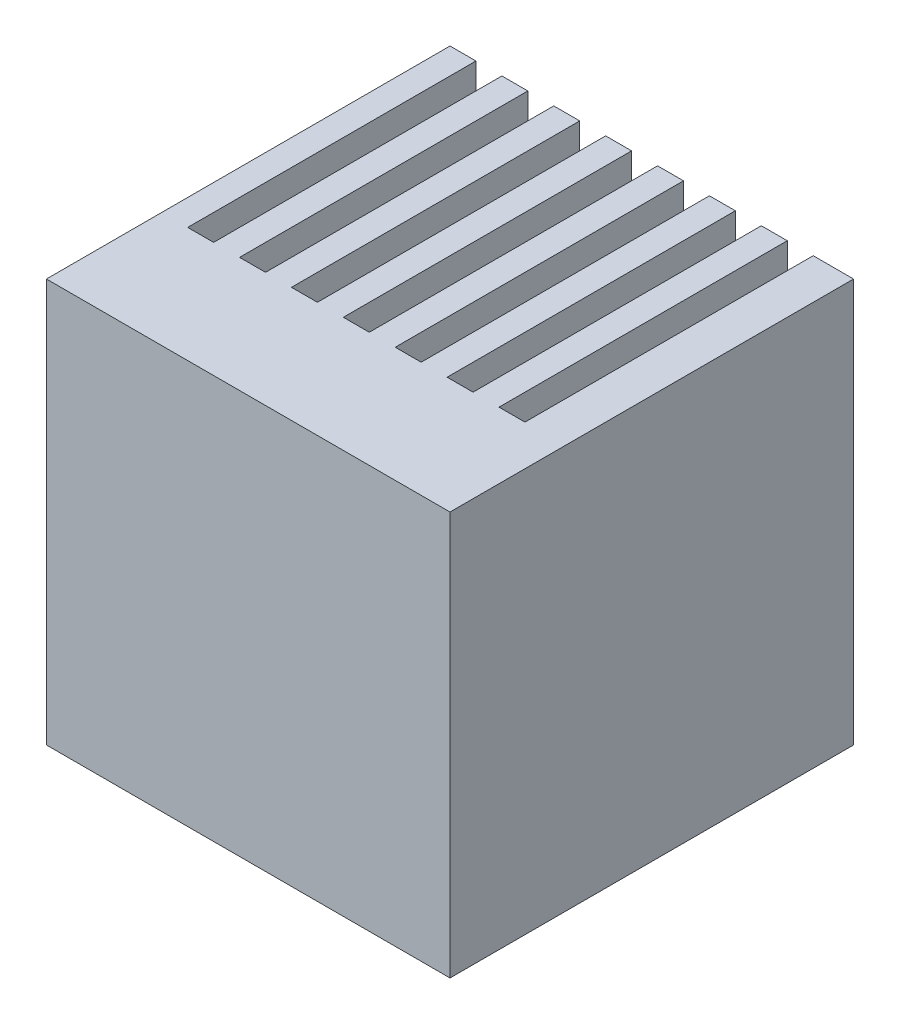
ISO-10303-21;
HEADER;
FILE_DESCRIPTION(('STEP AP214'),'2;1');
FILE_NAME('part.step','',(''),(''),'','','');
FILE_SCHEMA(('AUTOMOTIVE_DESIGN { 1 0 10303 214 1 1 1 1 }'));
ENDSEC;
DATA;
#1=APPLICATION_CONTEXT('core data for automotive mechanical design processes');
#2=APPLICATION_PROTOCOL_DEFINITION('international standard','automotive_design',2000,#1);
#3=PRODUCT_CONTEXT('',#1,'mechanical');
#4=PRODUCT('Part','Part','',(#3));
#5=PRODUCT_RELATED_PRODUCT_CATEGORY('part','',(#4));
#6=PRODUCT_DEFINITION_FORMATION('','',#4);
#7=PRODUCT_DEFINITION_CONTEXT('part definition',#1,'design');
#8=PRODUCT_DEFINITION('design','',#6,#7);
#9=PRODUCT_DEFINITION_SHAPE('','',#8);
#10=(LENGTH_UNIT() NAMED_UNIT(*) SI_UNIT(.MILLI.,.METRE.));
#11=(NAMED_UNIT(*) PLANE_ANGLE_UNIT() SI_UNIT($,.RADIAN.));
#12=(NAMED_UNIT(*) SI_UNIT($,.STERADIAN.) SOLID_ANGLE_UNIT());
#13=UNCERTAINTY_MEASURE_WITH_UNIT(LENGTH_MEASURE(1.E-05),#10,'distance_accuracy_value','');
#14=(GEOMETRIC_REPRESENTATION_CONTEXT(3) GLOBAL_UNCERTAINTY_ASSIGNED_CONTEXT((#13)) GLOBAL_UNIT_ASSIGNED_CONTEXT((#10,
#11,#12)) REPRESENTATION_CONTEXT('',''));
#15=CARTESIAN_POINT('',(0.,0.,0.));
#16=DIRECTION('',(0.,0.,1.));
#17=DIRECTION('',(1.,0.,0.));
#18=AXIS2_PLACEMENT_3D('',#15,#16,#17);
#19=CARTESIAN_POINT('',(0.,28.,0.));
#20=DIRECTION('',(0.,0.,1.));
#21=DIRECTION('',(1.,0.,0.));
#22=AXIS2_PLACEMENT_3D('',#19,#20,#21);
#23=PLANE('',#22);
#24=DIRECTION('',(-1.,0.,0.));
#25=VECTOR('',#24,1.);
#26=CARTESIAN_POINT('',(0.,28.,0.));
#27=LINE('',#26,#25);
#28=CARTESIAN_POINT('',(5.4,28.,0.));
#29=VERTEX_POINT('',#28);
#30=CARTESIAN_POINT('',(3.6,28.,0.));
#31=VERTEX_POINT('',#30);
#32=EDGE_CURVE('E448',#29,#31,#27,.T.);
#33=ORIENTED_EDGE('',*,*,#32,.F.);
#34=DIRECTION('',(0.,1.,0.));
#35=VECTOR('',#34,1.);
#36=CARTESIAN_POINT('',(5.4,0.,0.));
#37=LINE('',#36,#35);
#38=CARTESIAN_POINT('',(5.4,0.,0.));
#39=VERTEX_POINT('',#38);
#40=EDGE_CURVE('E274',#39,#29,#37,.T.);
#41=ORIENTED_EDGE('',*,*,#40,.F.);
#42=DIRECTION('',(-1.,0.,0.));
#43=VECTOR('',#42,1.);
#44=CARTESIAN_POINT('',(0.,0.,0.));
#45=LINE('',#44,#43);
#46=CARTESIAN_POINT('',(3.6,0.,0.));
#47=VERTEX_POINT('',#46);
#48=EDGE_CURVE('E264',#39,#47,#45,.T.);
#49=ORIENTED_EDGE('',*,*,#48,.T.);
#50=DIRECTION('',(0.,1.,0.));
#51=VECTOR('',#50,1.);
#52=CARTESIAN_POINT('',(3.6,0.,0.));
#53=LINE('',#52,#51);
#54=EDGE_CURVE('E428',#47,#31,#53,.T.);
#55=ORIENTED_EDGE('',*,*,#54,.T.);
#56=EDGE_LOOP('',(#33,#41,#49,#55));
#57=FACE_BOUND('',#56,.T.);
#58=ADVANCED_FACE('F35',(#57),#23,.F.);
#59=CARTESIAN_POINT('',(9.,0.,0.));
#60=VERTEX_POINT('',#59);
#61=CARTESIAN_POINT('',(7.2,0.,0.));
#62=VERTEX_POINT('',#61);
#63=EDGE_CURVE('E488',#60,#62,#45,.T.);
#64=ORIENTED_EDGE('',*,*,#63,.T.);
#65=DIRECTION('',(0.,1.,0.));
#66=VECTOR('',#65,1.);
#67=CARTESIAN_POINT('',(7.2,0.,0.));
#68=LINE('',#67,#66);
#69=CARTESIAN_POINT('',(7.2,28.,0.));
#70=VERTEX_POINT('',#69);
#71=EDGE_CURVE('E277',#62,#70,#68,.T.);
#72=ORIENTED_EDGE('',*,*,#71,.T.);
#73=CARTESIAN_POINT('',(9.,28.,0.));
#74=VERTEX_POINT('',#73);
#75=EDGE_CURVE('E531',#74,#70,#27,.T.);
#76=ORIENTED_EDGE('',*,*,#75,.F.);
#77=DIRECTION('',(0.,1.,0.));
#78=VECTOR('',#77,1.);
#79=CARTESIAN_POINT('',(9.,0.,0.));
#80=LINE('',#79,#78);
#81=EDGE_CURVE('E272',#60,#74,#80,.T.);
#82=ORIENTED_EDGE('',*,*,#81,.F.);
#83=EDGE_LOOP('',(#64,#72,#76,#82));
#84=FACE_BOUND('',#83,.T.);
#85=ADVANCED_FACE('F512',(#84),#23,.F.);
#86=CARTESIAN_POINT('',(12.6,0.,0.));
#87=VERTEX_POINT('',#86);
#88=CARTESIAN_POINT('',(10.8,0.,0.));
#89=VERTEX_POINT('',#88);
#90=EDGE_CURVE('E500',#87,#89,#45,.T.);
#91=ORIENTED_EDGE('',*,*,#90,.T.);
#92=DIRECTION('',(0.,1.,0.));
#93=VECTOR('',#92,1.);
#94=CARTESIAN_POINT('',(10.8,0.,0.));
#95=LINE('',#94,#93);
#96=CARTESIAN_POINT('',(10.8,28.,0.));
#97=VERTEX_POINT('',#96);
#98=EDGE_CURVE('E299',#89,#97,#95,.T.);
#99=ORIENTED_EDGE('',*,*,#98,.T.);
#100=CARTESIAN_POINT('',(12.6,28.,0.));
#101=VERTEX_POINT('',#100);
#102=EDGE_CURVE('E527',#101,#97,#27,.T.);
#103=ORIENTED_EDGE('',*,*,#102,.F.);
#104=DIRECTION('',(0.,1.,0.));
#105=VECTOR('',#104,1.);
#106=CARTESIAN_POINT('',(12.6,0.,0.));
#107=LINE('',#106,#105);
#108=EDGE_CURVE('E294',#87,#101,#107,.T.);
#109=ORIENTED_EDGE('',*,*,#108,.F.);
#110=EDGE_LOOP('',(#91,#99,#103,#109));
#111=FACE_BOUND('',#110,.T.);
#112=ADVANCED_FACE('F526',(#111),#23,.F.);
#113=CARTESIAN_POINT('',(16.2,0.,0.));
#114=VERTEX_POINT('',#113);
#115=CARTESIAN_POINT('',(14.4,0.,0.));
#116=VERTEX_POINT('',#115);
#117=EDGE_CURVE('E495',#114,#116,#45,.T.);
#118=ORIENTED_EDGE('',*,*,#117,.T.);
#119=DIRECTION('',(0.,1.,0.));
#120=VECTOR('',#119,1.);
#121=CARTESIAN_POINT('',(14.4,0.,0.));
#122=LINE('',#121,#120);
#123=CARTESIAN_POINT('',(14.4,28.,0.));
#124=VERTEX_POINT('',#123);
#125=EDGE_CURVE('E325',#116,#124,#122,.T.);
#126=ORIENTED_EDGE('',*,*,#125,.T.);
#127=CARTESIAN_POINT('',(16.2,28.,0.));
#128=VERTEX_POINT('',#127);
#129=EDGE_CURVE('E530',#128,#124,#27,.T.);
#130=ORIENTED_EDGE('',*,*,#129,.F.);
#131=DIRECTION('',(0.,1.,0.));
#132=VECTOR('',#131,1.);
#133=CARTESIAN_POINT('',(16.2,0.,0.));
#134=LINE('',#133,#132);
#135=EDGE_CURVE('E320',#114,#128,#134,.T.);
#136=ORIENTED_EDGE('',*,*,#135,.F.);
#137=EDGE_LOOP('',(#118,#126,#130,#136));
#138=FACE_BOUND('',#137,.T.);
#139=ADVANCED_FACE('F560',(#138),#23,.F.);
#140=CARTESIAN_POINT('',(19.8,0.,0.));
#141=VERTEX_POINT('',#140);
#142=CARTESIAN_POINT('',(18.,0.,0.));
#143=VERTEX_POINT('',#142);
#144=EDGE_CURVE('E490',#141,#143,#45,.T.);
#145=ORIENTED_EDGE('',*,*,#144,.T.);
#146=DIRECTION('',(0.,1.,0.));
#147=VECTOR('',#146,1.);
#148=CARTESIAN_POINT('',(18.,0.,0.));
#149=LINE('',#148,#147);
#150=CARTESIAN_POINT('',(18.,28.,0.));
#151=VERTEX_POINT('',#150);
#152=EDGE_CURVE('E351',#143,#151,#149,.T.);
#153=ORIENTED_EDGE('',*,*,#152,.T.);
#154=CARTESIAN_POINT('',(19.8,28.,0.));
#155=VERTEX_POINT('',#154);
#156=EDGE_CURVE('E533',#155,#151,#27,.T.);
#157=ORIENTED_EDGE('',*,*,#156,.F.);
#158=DIRECTION('',(0.,1.,0.));
#159=VECTOR('',#158,1.);
#160=CARTESIAN_POINT('',(19.8,0.,0.));
#161=LINE('',#160,#159);
#162=EDGE_CURVE('E346',#141,#155,#161,.T.);
#163=ORIENTED_EDGE('',*,*,#162,.F.);
#164=EDGE_LOOP('',(#145,#153,#157,#163));
#165=FACE_BOUND('',#164,.T.);
#166=ADVANCED_FACE('F549',(#165),#23,.F.);
#167=CARTESIAN_POINT('',(23.4,0.,0.));
#168=VERTEX_POINT('',#167);
#169=CARTESIAN_POINT('',(21.6,0.,0.));
#170=VERTEX_POINT('',#169);
#171=EDGE_CURVE('E458',#168,#170,#45,.T.);
#172=ORIENTED_EDGE('',*,*,#171,.T.);
#173=DIRECTION('',(0.,1.,0.));
#174=VECTOR('',#173,1.);
#175=CARTESIAN_POINT('',(21.6,0.,0.));
#176=LINE('',#175,#174);
#177=CARTESIAN_POINT('',(21.6,28.,0.));
#178=VERTEX_POINT('',#177);
#179=EDGE_CURVE('E377',#170,#178,#176,.T.);
#180=ORIENTED_EDGE('',*,*,#179,.T.);
#181=CARTESIAN_POINT('',(23.4,28.,0.));
#182=VERTEX_POINT('',#181);
#183=EDGE_CURVE('E447',#182,#178,#27,.T.);
#184=ORIENTED_EDGE('',*,*,#183,.F.);
#185=DIRECTION('',(0.,1.,0.));
#186=VECTOR('',#185,1.);
#187=CARTESIAN_POINT('',(23.4,0.,0.));
#188=LINE('',#187,#186);
#189=EDGE_CURVE('E372',#168,#182,#188,.T.);
#190=ORIENTED_EDGE('',*,*,#189,.F.);
#191=EDGE_LOOP('',(#172,#180,#184,#190));
#192=FACE_BOUND('',#191,.T.);
#193=ADVANCED_FACE('F595',(#192),#23,.F.);
#194=CARTESIAN_POINT('',(1.8,28.,0.));
#195=VERTEX_POINT('',#194);
#196=CARTESIAN_POINT('',(0.,28.,0.));
#197=VERTEX_POINT('',#196);
#198=EDGE_CURVE('E442',#195,#197,#27,.T.);
#199=ORIENTED_EDGE('',*,*,#198,.F.);
#200=DIRECTION('',(0.,1.,0.));
#201=VECTOR('',#200,1.);
#202=CARTESIAN_POINT('',(1.8,0.,0.));
#203=LINE('',#202,#201);
#204=CARTESIAN_POINT('',(1.8,0.,0.));
#205=VERTEX_POINT('',#204);
#206=EDGE_CURVE('E425',#205,#195,#203,.T.);
#207=ORIENTED_EDGE('',*,*,#206,.F.);
#208=CARTESIAN_POINT('',(0.,0.,0.));
#209=VERTEX_POINT('',#208);
#210=EDGE_CURVE('E455',#205,#209,#45,.T.);
#211=ORIENTED_EDGE('',*,*,#210,.T.);
#212=DIRECTION('',(0.,-1.,0.));
#213=VECTOR('',#212,1.);
#214=CARTESIAN_POINT('',(0.,28.,0.));
#215=LINE('',#214,#213);
#216=EDGE_CURVE('E446',#197,#209,#215,.T.);
#217=ORIENTED_EDGE('',*,*,#216,.F.);
#218=EDGE_LOOP('',(#199,#207,#211,#217));
#219=FACE_BOUND('',#218,.T.);
#220=ADVANCED_FACE('F588',(#219),#23,.F.);
#221=CARTESIAN_POINT('',(0.,28.,0.));
#222=DIRECTION('',(1.,0.,0.));
#223=DIRECTION('',(0.,0.,-1.));
#224=AXIS2_PLACEMENT_3D('',#221,#222,#223);
#225=PLANE('',#224);
#226=DIRECTION('',(0.,0.,1.));
#227=VECTOR('',#226,1.);
#228=CARTESIAN_POINT('',(0.,0.,0.));
#229=LINE('',#228,#227);
#230=CARTESIAN_POINT('',(0.,0.,28.));
#231=VERTEX_POINT('',#230);
#232=EDGE_CURVE('E427',#209,#231,#229,.T.);
#233=ORIENTED_EDGE('',*,*,#232,.T.);
#234=DIRECTION('',(0.,-1.,0.));
#235=VECTOR('',#234,1.);
#236=CARTESIAN_POINT('',(0.,28.,28.));
#237=LINE('',#236,#235);
#238=CARTESIAN_POINT('',(0.,28.,28.));
#239=VERTEX_POINT('',#238);
#240=EDGE_CURVE('E11',#239,#231,#237,.T.);
#241=ORIENTED_EDGE('',*,*,#240,.F.);
#242=DIRECTION('',(0.,0.,1.));
#243=VECTOR('',#242,1.);
#244=CARTESIAN_POINT('',(0.,28.,0.));
#245=LINE('',#244,#243);
#246=EDGE_CURVE('E434',#197,#239,#245,.T.);
#247=ORIENTED_EDGE('',*,*,#246,.F.);
#248=ORIENTED_EDGE('',*,*,#216,.T.);
#249=EDGE_LOOP('',(#233,#241,#247,#248));
#250=FACE_BOUND('',#249,.T.);
#251=ADVANCED_FACE('F37',(#250),#225,.F.);
#252=CARTESIAN_POINT('',(0.,28.,28.));
#253=DIRECTION('',(0.,0.,-1.));
#254=DIRECTION('',(-1.,0.,0.));
#255=AXIS2_PLACEMENT_3D('',#252,#253,#254);
#256=PLANE('',#255);
#257=DIRECTION('',(1.,0.,0.));
#258=VECTOR('',#257,1.);
#259=CARTESIAN_POINT('',(0.,0.,28.));
#260=LINE('',#259,#258);
#261=CARTESIAN_POINT('',(28.,0.,28.));
#262=VERTEX_POINT('',#261);
#263=EDGE_CURVE('E451',#231,#262,#260,.T.);
#264=ORIENTED_EDGE('',*,*,#263,.T.);
#265=DIRECTION('',(0.,-1.,0.));
#266=VECTOR('',#265,1.);
#267=CARTESIAN_POINT('',(28.,28.,28.));
#268=LINE('',#267,#266);
#269=CARTESIAN_POINT('',(28.,28.,28.));
#270=VERTEX_POINT('',#269);
#271=EDGE_CURVE('E43',#270,#262,#268,.T.);
#272=ORIENTED_EDGE('',*,*,#271,.F.);
#273=DIRECTION('',(1.,0.,0.));
#274=VECTOR('',#273,1.);
#275=CARTESIAN_POINT('',(0.,28.,28.));
#276=LINE('',#275,#274);
#277=EDGE_CURVE('E437',#239,#270,#276,.T.);
#278=ORIENTED_EDGE('',*,*,#277,.F.);
#279=ORIENTED_EDGE('',*,*,#240,.T.);
#280=EDGE_LOOP('',(#264,#272,#278,#279));
#281=FACE_BOUND('',#280,.T.);
#282=ADVANCED_FACE('F482',(#281),#256,.F.);
#283=CARTESIAN_POINT('',(28.,28.,0.));
#284=DIRECTION('',(-1.,0.,0.));
#285=DIRECTION('',(0.,0.,1.));
#286=AXIS2_PLACEMENT_3D('',#283,#284,#285);
#287=PLANE('',#286);
#288=DIRECTION('',(0.,0.,-1.));
#289=VECTOR('',#288,1.);
#290=CARTESIAN_POINT('',(28.,0.,0.));
#291=LINE('',#290,#289);
#292=CARTESIAN_POINT('',(28.,0.,0.));
#293=VERTEX_POINT('',#292);
#294=EDGE_CURVE('E453',#262,#293,#291,.T.);
#295=ORIENTED_EDGE('',*,*,#294,.T.);
#296=DIRECTION('',(0.,-1.,0.));
#297=VECTOR('',#296,1.);
#298=CARTESIAN_POINT('',(28.,28.,0.));
#299=LINE('',#298,#297);
#300=CARTESIAN_POINT('',(28.,28.,0.));
#301=VERTEX_POINT('',#300);
#302=EDGE_CURVE('E461',#301,#293,#299,.T.);
#303=ORIENTED_EDGE('',*,*,#302,.F.);
#304=DIRECTION('',(0.,0.,-1.));
#305=VECTOR('',#304,1.);
#306=CARTESIAN_POINT('',(28.,28.,0.));
#307=LINE('',#306,#305);
#308=EDGE_CURVE('E440',#270,#301,#307,.T.);
#309=ORIENTED_EDGE('',*,*,#308,.F.);
#310=ORIENTED_EDGE('',*,*,#271,.T.);
#311=EDGE_LOOP('',(#295,#303,#309,#310));
#312=FACE_BOUND('',#311,.T.);
#313=ADVANCED_FACE('F468',(#312),#287,.F.);
#314=CARTESIAN_POINT('',(25.2,0.,0.));
#315=VERTEX_POINT('',#314);
#316=EDGE_CURVE('E438',#293,#315,#45,.T.);
#317=ORIENTED_EDGE('',*,*,#316,.T.);
#318=DIRECTION('',(0.,1.,0.));
#319=VECTOR('',#318,1.);
#320=CARTESIAN_POINT('',(25.2,0.,0.));
#321=LINE('',#320,#319);
#322=CARTESIAN_POINT('',(25.2,28.,0.));
#323=VERTEX_POINT('',#322);
#324=EDGE_CURVE('E402',#315,#323,#321,.T.);
#325=ORIENTED_EDGE('',*,*,#324,.T.);
#326=EDGE_CURVE('E443',#301,#323,#27,.T.);
#327=ORIENTED_EDGE('',*,*,#326,.F.);
#328=ORIENTED_EDGE('',*,*,#302,.T.);
#329=EDGE_LOOP('',(#317,#325,#327,#328));
#330=FACE_BOUND('',#329,.T.);
#331=ADVANCED_FACE('F474',(#330),#23,.F.);
#332=CARTESIAN_POINT('',(0.,28.,0.));
#333=DIRECTION('',(0.,1.,0.));
#334=DIRECTION('',(0.,0.,1.));
#335=AXIS2_PLACEMENT_3D('',#332,#333,#334);
#336=PLANE('',#335);
#337=DIRECTION('',(0.,0.,1.));
#338=VECTOR('',#337,1.);
#339=CARTESIAN_POINT('',(5.4,28.,0.));
#340=LINE('',#339,#338);
#341=CARTESIAN_POINT('',(5.4,28.,20.));
#342=VERTEX_POINT('',#341);
#343=EDGE_CURVE('E250',#29,#342,#340,.T.);
#344=ORIENTED_EDGE('',*,*,#343,.F.);
#345=ORIENTED_EDGE('',*,*,#32,.T.);
#346=DIRECTION('',(0.,0.,-1.));
#347=VECTOR('',#346,1.);
#348=CARTESIAN_POINT('',(3.6,28.,0.));
#349=LINE('',#348,#347);
#350=CARTESIAN_POINT('',(3.6,28.,20.));
#351=VERTEX_POINT('',#350);
#352=EDGE_CURVE('E412',#351,#31,#349,.T.);
#353=ORIENTED_EDGE('',*,*,#352,.F.);
#354=DIRECTION('',(1.,0.,0.));
#355=VECTOR('',#354,1.);
#356=CARTESIAN_POINT('',(1.8,28.,20.));
#357=LINE('',#356,#355);
#358=CARTESIAN_POINT('',(1.8,28.,20.));
#359=VERTEX_POINT('',#358);
#360=EDGE_CURVE('E420',#359,#351,#357,.T.);
#361=ORIENTED_EDGE('',*,*,#360,.F.);
#362=DIRECTION('',(0.,0.,1.));
#363=VECTOR('',#362,1.);
#364=CARTESIAN_POINT('',(1.8,28.,0.));
#365=LINE('',#364,#363);
#366=EDGE_CURVE('E276',#195,#359,#365,.T.);
#367=ORIENTED_EDGE('',*,*,#366,.F.);
#368=ORIENTED_EDGE('',*,*,#198,.T.);
#369=ORIENTED_EDGE('',*,*,#246,.T.);
#370=ORIENTED_EDGE('',*,*,#277,.T.);
#371=ORIENTED_EDGE('',*,*,#308,.T.);
#372=ORIENTED_EDGE('',*,*,#326,.T.);
#373=DIRECTION('',(0.,0.,-1.));
#374=VECTOR('',#373,1.);
#375=CARTESIAN_POINT('',(25.2,28.,0.));
#376=LINE('',#375,#374);
#377=CARTESIAN_POINT('',(25.2,28.,20.));
#378=VERTEX_POINT('',#377);
#379=EDGE_CURVE('E387',#378,#323,#376,.T.);
#380=ORIENTED_EDGE('',*,*,#379,.F.);
#381=DIRECTION('',(1.,0.,0.));
#382=VECTOR('',#381,1.);
#383=CARTESIAN_POINT('',(23.4,28.,20.));
#384=LINE('',#383,#382);
#385=CARTESIAN_POINT('',(23.4,28.,20.));
#386=VERTEX_POINT('',#385);
#387=EDGE_CURVE('E397',#386,#378,#384,.T.);
#388=ORIENTED_EDGE('',*,*,#387,.F.);
#389=DIRECTION('',(0.,0.,1.));
#390=VECTOR('',#389,1.);
#391=CARTESIAN_POINT('',(23.4,28.,0.));
#392=LINE('',#391,#390);
#393=EDGE_CURVE('E394',#182,#386,#392,.T.);
#394=ORIENTED_EDGE('',*,*,#393,.F.);
#395=ORIENTED_EDGE('',*,*,#183,.T.);
#396=DIRECTION('',(0.,0.,-1.));
#397=VECTOR('',#396,1.);
#398=CARTESIAN_POINT('',(21.6,28.,0.));
#399=LINE('',#398,#397);
#400=CARTESIAN_POINT('',(21.6,28.,20.));
#401=VERTEX_POINT('',#400);
#402=EDGE_CURVE('E361',#401,#178,#399,.T.);
#403=ORIENTED_EDGE('',*,*,#402,.F.);
#404=DIRECTION('',(1.,0.,0.));
#405=VECTOR('',#404,1.);
#406=CARTESIAN_POINT('',(19.8,28.,20.));
#407=LINE('',#406,#405);
#408=CARTESIAN_POINT('',(19.8,28.,20.));
#409=VERTEX_POINT('',#408);
#410=EDGE_CURVE('E371',#409,#401,#407,.T.);
#411=ORIENTED_EDGE('',*,*,#410,.F.);
#412=DIRECTION('',(0.,0.,1.));
#413=VECTOR('',#412,1.);
#414=CARTESIAN_POINT('',(19.8,28.,0.));
#415=LINE('',#414,#413);
#416=EDGE_CURVE('E368',#155,#409,#415,.T.);
#417=ORIENTED_EDGE('',*,*,#416,.F.);
#418=ORIENTED_EDGE('',*,*,#156,.T.);
#419=DIRECTION('',(0.,0.,-1.));
#420=VECTOR('',#419,1.);
#421=CARTESIAN_POINT('',(18.,28.,0.));
#422=LINE('',#421,#420);
#423=CARTESIAN_POINT('',(18.,28.,20.));
#424=VERTEX_POINT('',#423);
#425=EDGE_CURVE('E335',#424,#151,#422,.T.);
#426=ORIENTED_EDGE('',*,*,#425,.F.);
#427=DIRECTION('',(1.,0.,0.));
#428=VECTOR('',#427,1.);
#429=CARTESIAN_POINT('',(16.2,28.,20.));
#430=LINE('',#429,#428);
#431=CARTESIAN_POINT('',(16.2,28.,20.));
#432=VERTEX_POINT('',#431);
#433=EDGE_CURVE('E345',#432,#424,#430,.T.);
#434=ORIENTED_EDGE('',*,*,#433,.F.);
#435=DIRECTION('',(0.,0.,1.));
#436=VECTOR('',#435,1.);
#437=CARTESIAN_POINT('',(16.2,28.,0.));
#438=LINE('',#437,#436);
#439=EDGE_CURVE('E342',#128,#432,#438,.T.);
#440=ORIENTED_EDGE('',*,*,#439,.F.);
#441=ORIENTED_EDGE('',*,*,#129,.T.);
#442=DIRECTION('',(0.,0.,-1.));
#443=VECTOR('',#442,1.);
#444=CARTESIAN_POINT('',(14.4,28.,0.));
#445=LINE('',#444,#443);
#446=CARTESIAN_POINT('',(14.4,28.,20.));
#447=VERTEX_POINT('',#446);
#448=EDGE_CURVE('E309',#447,#124,#445,.T.);
#449=ORIENTED_EDGE('',*,*,#448,.F.);
#450=DIRECTION('',(1.,0.,0.));
#451=VECTOR('',#450,1.);
#452=CARTESIAN_POINT('',(12.6,28.,20.));
#453=LINE('',#452,#451);
#454=CARTESIAN_POINT('',(12.6,28.,20.));
#455=VERTEX_POINT('',#454);
#456=EDGE_CURVE('E319',#455,#447,#453,.T.);
#457=ORIENTED_EDGE('',*,*,#456,.F.);
#458=DIRECTION('',(0.,0.,1.));
#459=VECTOR('',#458,1.);
#460=CARTESIAN_POINT('',(12.6,28.,0.));
#461=LINE('',#460,#459);
#462=EDGE_CURVE('E316',#101,#455,#461,.T.);
#463=ORIENTED_EDGE('',*,*,#462,.F.);
#464=ORIENTED_EDGE('',*,*,#102,.T.);
#465=DIRECTION('',(0.,0.,-1.));
#466=VECTOR('',#465,1.);
#467=CARTESIAN_POINT('',(10.8,28.,0.));
#468=LINE('',#467,#466);
#469=CARTESIAN_POINT('',(10.8,28.,20.));
#470=VERTEX_POINT('',#469);
#471=EDGE_CURVE('E285',#470,#97,#468,.T.);
#472=ORIENTED_EDGE('',*,*,#471,.F.);
#473=DIRECTION('',(1.,0.,0.));
#474=VECTOR('',#473,1.);
#475=CARTESIAN_POINT('',(9.,28.,20.));
#476=LINE('',#475,#474);
#477=CARTESIAN_POINT('',(9.,28.,20.));
#478=VERTEX_POINT('',#477);
#479=EDGE_CURVE('E293',#478,#470,#476,.T.);
#480=ORIENTED_EDGE('',*,*,#479,.F.);
#481=DIRECTION('',(0.,0.,1.));
#482=VECTOR('',#481,1.);
#483=CARTESIAN_POINT('',(9.,28.,0.));
#484=LINE('',#483,#482);
#485=EDGE_CURVE('E290',#74,#478,#484,.T.);
#486=ORIENTED_EDGE('',*,*,#485,.F.);
#487=ORIENTED_EDGE('',*,*,#75,.T.);
#488=DIRECTION('',(0.,0.,-1.));
#489=VECTOR('',#488,1.);
#490=CARTESIAN_POINT('',(7.2,28.,0.));
#491=LINE('',#490,#489);
#492=CARTESIAN_POINT('',(7.2,28.,20.));
#493=VERTEX_POINT('',#492);
#494=EDGE_CURVE('E265',#493,#70,#491,.T.);
#495=ORIENTED_EDGE('',*,*,#494,.F.);
#496=DIRECTION('',(1.,0.,0.));
#497=VECTOR('',#496,1.);
#498=CARTESIAN_POINT('',(5.4,28.,20.));
#499=LINE('',#498,#497);
#500=EDGE_CURVE('E267',#342,#493,#499,.T.);
#501=ORIENTED_EDGE('',*,*,#500,.F.);
#502=EDGE_LOOP('',(#344,#345,#353,#361,#367,#368,#369,#370,#371,#372,#380,#388,#394,#395,#403,
#411,#417,#418,#426,#434,#440,#441,#449,#457,#463,#464,#472,#480,#486,#487,#495,#501));
#503=FACE_BOUND('',#502,.T.);
#504=ADVANCED_FACE('F478',(#503),#336,.T.);
#505=CARTESIAN_POINT('',(0.,0.,0.));
#506=DIRECTION('',(0.,1.,0.));
#507=DIRECTION('',(0.,0.,1.));
#508=AXIS2_PLACEMENT_3D('',#505,#506,#507);
#509=PLANE('',#508);
#510=ORIENTED_EDGE('',*,*,#48,.F.);
#511=DIRECTION('',(0.,0.,1.));
#512=VECTOR('',#511,1.);
#513=CARTESIAN_POINT('',(5.4,0.,0.));
#514=LINE('',#513,#512);
#515=CARTESIAN_POINT('',(5.4,0.,20.));
#516=VERTEX_POINT('',#515);
#517=EDGE_CURVE('E247',#39,#516,#514,.T.);
#518=ORIENTED_EDGE('',*,*,#517,.T.);
#519=DIRECTION('',(1.,0.,0.));
#520=VECTOR('',#519,1.);
#521=CARTESIAN_POINT('',(5.4,0.,20.));
#522=LINE('',#521,#520);
#523=CARTESIAN_POINT('',(7.2,0.,20.));
#524=VERTEX_POINT('',#523);
#525=EDGE_CURVE('E257',#516,#524,#522,.T.);
#526=ORIENTED_EDGE('',*,*,#525,.T.);
#527=DIRECTION('',(0.,0.,-1.));
#528=VECTOR('',#527,1.);
#529=CARTESIAN_POINT('',(7.2,0.,0.));
#530=LINE('',#529,#528);
#531=EDGE_CURVE('E50',#524,#62,#530,.T.);
#532=ORIENTED_EDGE('',*,*,#531,.T.);
#533=ORIENTED_EDGE('',*,*,#63,.F.);
#534=DIRECTION('',(0.,0.,1.));
#535=VECTOR('',#534,1.);
#536=CARTESIAN_POINT('',(9.,0.,0.));
#537=LINE('',#536,#535);
#538=CARTESIAN_POINT('',(9.,0.,20.));
#539=VERTEX_POINT('',#538);
#540=EDGE_CURVE('E281',#60,#539,#537,.T.);
#541=ORIENTED_EDGE('',*,*,#540,.T.);
#542=DIRECTION('',(1.,0.,0.));
#543=VECTOR('',#542,1.);
#544=CARTESIAN_POINT('',(9.,0.,20.));
#545=LINE('',#544,#543);
#546=CARTESIAN_POINT('',(10.8,0.,20.));
#547=VERTEX_POINT('',#546);
#548=EDGE_CURVE('E284',#539,#547,#545,.T.);
#549=ORIENTED_EDGE('',*,*,#548,.T.);
#550=DIRECTION('',(0.,0.,-1.));
#551=VECTOR('',#550,1.);
#552=CARTESIAN_POINT('',(10.8,0.,0.));
#553=LINE('',#552,#551);
#554=EDGE_CURVE('E58',#547,#89,#553,.T.);
#555=ORIENTED_EDGE('',*,*,#554,.T.);
#556=ORIENTED_EDGE('',*,*,#90,.F.);
#557=DIRECTION('',(0.,0.,1.));
#558=VECTOR('',#557,1.);
#559=CARTESIAN_POINT('',(12.6,0.,0.));
#560=LINE('',#559,#558);
#561=CARTESIAN_POINT('',(12.6,0.,20.));
#562=VERTEX_POINT('',#561);
#563=EDGE_CURVE('E305',#87,#562,#560,.T.);
#564=ORIENTED_EDGE('',*,*,#563,.T.);
#565=DIRECTION('',(1.,0.,0.));
#566=VECTOR('',#565,1.);
#567=CARTESIAN_POINT('',(12.6,0.,20.));
#568=LINE('',#567,#566);
#569=CARTESIAN_POINT('',(14.4,0.,20.));
#570=VERTEX_POINT('',#569);
#571=EDGE_CURVE('E308',#562,#570,#568,.T.);
#572=ORIENTED_EDGE('',*,*,#571,.T.);
#573=DIRECTION('',(0.,0.,-1.));
#574=VECTOR('',#573,1.);
#575=CARTESIAN_POINT('',(14.4,0.,0.));
#576=LINE('',#575,#574);
#577=EDGE_CURVE('E312',#570,#116,#576,.T.);
#578=ORIENTED_EDGE('',*,*,#577,.T.);
#579=ORIENTED_EDGE('',*,*,#117,.F.);
#580=DIRECTION('',(0.,0.,1.));
#581=VECTOR('',#580,1.);
#582=CARTESIAN_POINT('',(16.2,0.,0.));
#583=LINE('',#582,#581);
#584=CARTESIAN_POINT('',(16.2,0.,20.));
#585=VERTEX_POINT('',#584);
#586=EDGE_CURVE('E331',#114,#585,#583,.T.);
#587=ORIENTED_EDGE('',*,*,#586,.T.);
#588=DIRECTION('',(1.,0.,0.));
#589=VECTOR('',#588,1.);
#590=CARTESIAN_POINT('',(16.2,0.,20.));
#591=LINE('',#590,#589);
#592=CARTESIAN_POINT('',(18.,0.,20.));
#593=VERTEX_POINT('',#592);
#594=EDGE_CURVE('E334',#585,#593,#591,.T.);
#595=ORIENTED_EDGE('',*,*,#594,.T.);
#596=DIRECTION('',(0.,0.,-1.));
#597=VECTOR('',#596,1.);
#598=CARTESIAN_POINT('',(18.,0.,0.));
#599=LINE('',#598,#597);
#600=EDGE_CURVE('E338',#593,#143,#599,.T.);
#601=ORIENTED_EDGE('',*,*,#600,.T.);
#602=ORIENTED_EDGE('',*,*,#144,.F.);
#603=DIRECTION('',(0.,0.,1.));
#604=VECTOR('',#603,1.);
#605=CARTESIAN_POINT('',(19.8,0.,0.));
#606=LINE('',#605,#604);
#607=CARTESIAN_POINT('',(19.8,0.,20.));
#608=VERTEX_POINT('',#607);
#609=EDGE_CURVE('E357',#141,#608,#606,.T.);
#610=ORIENTED_EDGE('',*,*,#609,.T.);
#611=DIRECTION('',(1.,0.,0.));
#612=VECTOR('',#611,1.);
#613=CARTESIAN_POINT('',(19.8,0.,20.));
#614=LINE('',#613,#612);
#615=CARTESIAN_POINT('',(21.6,0.,20.));
#616=VERTEX_POINT('',#615);
#617=EDGE_CURVE('E360',#608,#616,#614,.T.);
#618=ORIENTED_EDGE('',*,*,#617,.T.);
#619=DIRECTION('',(0.,0.,-1.));
#620=VECTOR('',#619,1.);
#621=CARTESIAN_POINT('',(21.6,0.,0.));
#622=LINE('',#621,#620);
#623=EDGE_CURVE('E364',#616,#170,#622,.T.);
#624=ORIENTED_EDGE('',*,*,#623,.T.);
#625=ORIENTED_EDGE('',*,*,#171,.F.);
#626=DIRECTION('',(0.,0.,1.));
#627=VECTOR('',#626,1.);
#628=CARTESIAN_POINT('',(23.4,0.,0.));
#629=LINE('',#628,#627);
#630=CARTESIAN_POINT('',(23.4,0.,20.));
#631=VERTEX_POINT('',#630);
#632=EDGE_CURVE('E383',#168,#631,#629,.T.);
#633=ORIENTED_EDGE('',*,*,#632,.T.);
#634=DIRECTION('',(1.,0.,0.));
#635=VECTOR('',#634,1.);
#636=CARTESIAN_POINT('',(23.4,0.,20.));
#637=LINE('',#636,#635);
#638=CARTESIAN_POINT('',(25.2,0.,20.));
#639=VERTEX_POINT('',#638);
#640=EDGE_CURVE('E386',#631,#639,#637,.T.);
#641=ORIENTED_EDGE('',*,*,#640,.T.);
#642=DIRECTION('',(0.,0.,-1.));
#643=VECTOR('',#642,1.);
#644=CARTESIAN_POINT('',(25.2,0.,0.));
#645=LINE('',#644,#643);
#646=EDGE_CURVE('E390',#639,#315,#645,.T.);
#647=ORIENTED_EDGE('',*,*,#646,.T.);
#648=ORIENTED_EDGE('',*,*,#316,.F.);
#649=ORIENTED_EDGE('',*,*,#294,.F.);
#650=ORIENTED_EDGE('',*,*,#263,.F.);
#651=ORIENTED_EDGE('',*,*,#232,.F.);
#652=ORIENTED_EDGE('',*,*,#210,.F.);
#653=DIRECTION('',(0.,0.,1.));
#654=VECTOR('',#653,1.);
#655=CARTESIAN_POINT('',(1.8,0.,0.));
#656=LINE('',#655,#654);
#657=CARTESIAN_POINT('',(1.8,0.,20.));
#658=VERTEX_POINT('',#657);
#659=EDGE_CURVE('E408',#205,#658,#656,.T.);
#660=ORIENTED_EDGE('',*,*,#659,.T.);
#661=DIRECTION('',(1.,0.,0.));
#662=VECTOR('',#661,1.);
#663=CARTESIAN_POINT('',(1.8,0.,20.));
#664=LINE('',#663,#662);
#665=CARTESIAN_POINT('',(3.6,0.,20.));
#666=VERTEX_POINT('',#665);
#667=EDGE_CURVE('E411',#658,#666,#664,.T.);
#668=ORIENTED_EDGE('',*,*,#667,.T.);
#669=DIRECTION('',(0.,0.,-1.));
#670=VECTOR('',#669,1.);
#671=CARTESIAN_POINT('',(3.6,0.,0.));
#672=LINE('',#671,#670);
#673=EDGE_CURVE('E415',#666,#47,#672,.T.);
#674=ORIENTED_EDGE('',*,*,#673,.T.);
#675=EDGE_LOOP('',(#510,#518,#526,#532,#533,#541,#549,#555,#556,#564,#572,#578,#579,#587,#595,
#601,#602,#610,#618,#624,#625,#633,#641,#647,#648,#649,#650,#651,#652,#660,#668,#674));
#676=FACE_BOUND('',#675,.T.);
#677=ADVANCED_FACE('F262',(#676),#509,.F.);
#678=CARTESIAN_POINT('',(1.8,0.,0.));
#679=DIRECTION('',(-1.,0.,0.));
#680=DIRECTION('',(0.,0.,1.));
#681=AXIS2_PLACEMENT_3D('',#678,#679,#680);
#682=PLANE('',#681);
#683=ORIENTED_EDGE('',*,*,#366,.T.);
#684=DIRECTION('',(0.,1.,0.));
#685=VECTOR('',#684,1.);
#686=CARTESIAN_POINT('',(1.8,0.,20.));
#687=LINE('',#686,#685);
#688=EDGE_CURVE('E417',#658,#359,#687,.T.);
#689=ORIENTED_EDGE('',*,*,#688,.F.);
#690=ORIENTED_EDGE('',*,*,#659,.F.);
#691=ORIENTED_EDGE('',*,*,#206,.T.);
#692=EDGE_LOOP('',(#683,#689,#690,#691));
#693=FACE_BOUND('',#692,.T.);
#694=ADVANCED_FACE('F601',(#693),#682,.F.);
#695=CARTESIAN_POINT('',(3.6,0.,0.));
#696=DIRECTION('',(1.,0.,0.));
#697=DIRECTION('',(0.,0.,-1.));
#698=AXIS2_PLACEMENT_3D('',#695,#696,#697);
#699=PLANE('',#698);
#700=ORIENTED_EDGE('',*,*,#352,.T.);
#701=ORIENTED_EDGE('',*,*,#54,.F.);
#702=ORIENTED_EDGE('',*,*,#673,.F.);
#703=DIRECTION('',(0.,1.,0.));
#704=VECTOR('',#703,1.);
#705=CARTESIAN_POINT('',(3.6,0.,20.));
#706=LINE('',#705,#704);
#707=EDGE_CURVE('E431',#666,#351,#706,.T.);
#708=ORIENTED_EDGE('',*,*,#707,.T.);
#709=EDGE_LOOP('',(#700,#701,#702,#708));
#710=FACE_BOUND('',#709,.T.);
#711=ADVANCED_FACE('F609',(#710),#699,.F.);
#712=CARTESIAN_POINT('',(1.8,0.,20.));
#713=DIRECTION('',(0.,0.,1.));
#714=DIRECTION('',(1.,0.,0.));
#715=AXIS2_PLACEMENT_3D('',#712,#713,#714);
#716=PLANE('',#715);
#717=ORIENTED_EDGE('',*,*,#360,.T.);
#718=ORIENTED_EDGE('',*,*,#707,.F.);
#719=ORIENTED_EDGE('',*,*,#667,.F.);
#720=ORIENTED_EDGE('',*,*,#688,.T.);
#721=EDGE_LOOP('',(#717,#718,#719,#720));
#722=FACE_BOUND('',#721,.T.);
#723=ADVANCED_FACE('F605',(#722),#716,.F.);
#724=CARTESIAN_POINT('',(23.4,0.,0.));
#725=DIRECTION('',(-1.,0.,0.));
#726=DIRECTION('',(0.,0.,1.));
#727=AXIS2_PLACEMENT_3D('',#724,#725,#726);
#728=PLANE('',#727);
#729=ORIENTED_EDGE('',*,*,#393,.T.);
#730=DIRECTION('',(0.,1.,0.));
#731=VECTOR('',#730,1.);
#732=CARTESIAN_POINT('',(23.4,0.,20.));
#733=LINE('',#732,#731);
#734=EDGE_CURVE('E393',#631,#386,#733,.T.);
#735=ORIENTED_EDGE('',*,*,#734,.F.);
#736=ORIENTED_EDGE('',*,*,#632,.F.);
#737=ORIENTED_EDGE('',*,*,#189,.T.);
#738=EDGE_LOOP('',(#729,#735,#736,#737));
#739=FACE_BOUND('',#738,.T.);
#740=ADVANCED_FACE('F738',(#739),#728,.F.);
#741=CARTESIAN_POINT('',(25.2,0.,0.));
#742=DIRECTION('',(1.,0.,0.));
#743=DIRECTION('',(0.,0.,-1.));
#744=AXIS2_PLACEMENT_3D('',#741,#742,#743);
#745=PLANE('',#744);
#746=ORIENTED_EDGE('',*,*,#379,.T.);
#747=ORIENTED_EDGE('',*,*,#324,.F.);
#748=ORIENTED_EDGE('',*,*,#646,.F.);
#749=DIRECTION('',(0.,1.,0.));
#750=VECTOR('',#749,1.);
#751=CARTESIAN_POINT('',(25.2,0.,20.));
#752=LINE('',#751,#750);
#753=EDGE_CURVE('E405',#639,#378,#752,.T.);
#754=ORIENTED_EDGE('',*,*,#753,.T.);
#755=EDGE_LOOP('',(#746,#747,#748,#754));
#756=FACE_BOUND('',#755,.T.);
#757=ADVANCED_FACE('F729',(#756),#745,.F.);
#758=CARTESIAN_POINT('',(23.4,0.,20.));
#759=DIRECTION('',(0.,0.,1.));
#760=DIRECTION('',(1.,0.,0.));
#761=AXIS2_PLACEMENT_3D('',#758,#759,#760);
#762=PLANE('',#761);
#763=ORIENTED_EDGE('',*,*,#387,.T.);
#764=ORIENTED_EDGE('',*,*,#753,.F.);
#765=ORIENTED_EDGE('',*,*,#640,.F.);
#766=ORIENTED_EDGE('',*,*,#734,.T.);
#767=EDGE_LOOP('',(#763,#764,#765,#766));
#768=FACE_BOUND('',#767,.T.);
#769=ADVANCED_FACE('F720',(#768),#762,.F.);
#770=CARTESIAN_POINT('',(19.8,0.,0.));
#771=DIRECTION('',(-1.,0.,0.));
#772=DIRECTION('',(0.,0.,1.));
#773=AXIS2_PLACEMENT_3D('',#770,#771,#772);
#774=PLANE('',#773);
#775=ORIENTED_EDGE('',*,*,#416,.T.);
#776=DIRECTION('',(0.,1.,0.));
#777=VECTOR('',#776,1.);
#778=CARTESIAN_POINT('',(19.8,0.,20.));
#779=LINE('',#778,#777);
#780=EDGE_CURVE('E367',#608,#409,#779,.T.);
#781=ORIENTED_EDGE('',*,*,#780,.F.);
#782=ORIENTED_EDGE('',*,*,#609,.F.);
#783=ORIENTED_EDGE('',*,*,#162,.T.);
#784=EDGE_LOOP('',(#775,#781,#782,#783));
#785=FACE_BOUND('',#784,.T.);
#786=ADVANCED_FACE('F711',(#785),#774,.F.);
#787=CARTESIAN_POINT('',(21.6,0.,0.));
#788=DIRECTION('',(1.,0.,0.));
#789=DIRECTION('',(0.,0.,-1.));
#790=AXIS2_PLACEMENT_3D('',#787,#788,#789);
#791=PLANE('',#790);
#792=ORIENTED_EDGE('',*,*,#402,.T.);
#793=ORIENTED_EDGE('',*,*,#179,.F.);
#794=ORIENTED_EDGE('',*,*,#623,.F.);
#795=DIRECTION('',(0.,1.,0.));
#796=VECTOR('',#795,1.);
#797=CARTESIAN_POINT('',(21.6,0.,20.));
#798=LINE('',#797,#796);
#799=EDGE_CURVE('E380',#616,#401,#798,.T.);
#800=ORIENTED_EDGE('',*,*,#799,.T.);
#801=EDGE_LOOP('',(#792,#793,#794,#800));
#802=FACE_BOUND('',#801,.T.);
#803=ADVANCED_FACE('F702',(#802),#791,.F.);
#804=CARTESIAN_POINT('',(19.8,0.,20.));
#805=DIRECTION('',(0.,0.,1.));
#806=DIRECTION('',(1.,0.,0.));
#807=AXIS2_PLACEMENT_3D('',#804,#805,#806);
#808=PLANE('',#807);
#809=ORIENTED_EDGE('',*,*,#410,.T.);
#810=ORIENTED_EDGE('',*,*,#799,.F.);
#811=ORIENTED_EDGE('',*,*,#617,.F.);
#812=ORIENTED_EDGE('',*,*,#780,.T.);
#813=EDGE_LOOP('',(#809,#810,#811,#812));
#814=FACE_BOUND('',#813,.T.);
#815=ADVANCED_FACE('F694',(#814),#808,.F.);
#816=CARTESIAN_POINT('',(16.2,0.,0.));
#817=DIRECTION('',(-1.,0.,0.));
#818=DIRECTION('',(0.,0.,1.));
#819=AXIS2_PLACEMENT_3D('',#816,#817,#818);
#820=PLANE('',#819);
#821=ORIENTED_EDGE('',*,*,#439,.T.);
#822=DIRECTION('',(0.,1.,0.));
#823=VECTOR('',#822,1.);
#824=CARTESIAN_POINT('',(16.2,0.,20.));
#825=LINE('',#824,#823);
#826=EDGE_CURVE('E341',#585,#432,#825,.T.);
#827=ORIENTED_EDGE('',*,*,#826,.F.);
#828=ORIENTED_EDGE('',*,*,#586,.F.);
#829=ORIENTED_EDGE('',*,*,#135,.T.);
#830=EDGE_LOOP('',(#821,#827,#828,#829));
#831=FACE_BOUND('',#830,.T.);
#832=ADVANCED_FACE('F687',(#831),#820,.F.);
#833=CARTESIAN_POINT('',(18.,0.,0.));
#834=DIRECTION('',(1.,0.,0.));
#835=DIRECTION('',(0.,0.,-1.));
#836=AXIS2_PLACEMENT_3D('',#833,#834,#835);
#837=PLANE('',#836);
#838=ORIENTED_EDGE('',*,*,#425,.T.);
#839=ORIENTED_EDGE('',*,*,#152,.F.);
#840=ORIENTED_EDGE('',*,*,#600,.F.);
#841=DIRECTION('',(0.,1.,0.));
#842=VECTOR('',#841,1.);
#843=CARTESIAN_POINT('',(18.,0.,20.));
#844=LINE('',#843,#842);
#845=EDGE_CURVE('E354',#593,#424,#844,.T.);
#846=ORIENTED_EDGE('',*,*,#845,.T.);
#847=EDGE_LOOP('',(#838,#839,#840,#846));
#848=FACE_BOUND('',#847,.T.);
#849=ADVANCED_FACE('F551',(#848),#837,.F.);
#850=CARTESIAN_POINT('',(16.2,0.,20.));
#851=DIRECTION('',(0.,0.,1.));
#852=DIRECTION('',(1.,0.,0.));
#853=AXIS2_PLACEMENT_3D('',#850,#851,#852);
#854=PLANE('',#853);
#855=ORIENTED_EDGE('',*,*,#433,.T.);
#856=ORIENTED_EDGE('',*,*,#845,.F.);
#857=ORIENTED_EDGE('',*,*,#594,.F.);
#858=ORIENTED_EDGE('',*,*,#826,.T.);
#859=EDGE_LOOP('',(#855,#856,#857,#858));
#860=FACE_BOUND('',#859,.T.);
#861=ADVANCED_FACE('F555',(#860),#854,.F.);
#862=CARTESIAN_POINT('',(12.6,0.,0.));
#863=DIRECTION('',(-1.,0.,0.));
#864=DIRECTION('',(0.,0.,1.));
#865=AXIS2_PLACEMENT_3D('',#862,#863,#864);
#866=PLANE('',#865);
#867=ORIENTED_EDGE('',*,*,#462,.T.);
#868=DIRECTION('',(0.,1.,0.));
#869=VECTOR('',#868,1.);
#870=CARTESIAN_POINT('',(12.6,0.,20.));
#871=LINE('',#870,#869);
#872=EDGE_CURVE('E315',#562,#455,#871,.T.);
#873=ORIENTED_EDGE('',*,*,#872,.F.);
#874=ORIENTED_EDGE('',*,*,#563,.F.);
#875=ORIENTED_EDGE('',*,*,#108,.T.);
#876=EDGE_LOOP('',(#867,#873,#874,#875));
#877=FACE_BOUND('',#876,.T.);
#878=ADVANCED_FACE('F568',(#877),#866,.F.);
#879=CARTESIAN_POINT('',(14.4,0.,0.));
#880=DIRECTION('',(1.,0.,0.));
#881=DIRECTION('',(0.,0.,-1.));
#882=AXIS2_PLACEMENT_3D('',#879,#880,#881);
#883=PLANE('',#882);
#884=ORIENTED_EDGE('',*,*,#448,.T.);
#885=ORIENTED_EDGE('',*,*,#125,.F.);
#886=ORIENTED_EDGE('',*,*,#577,.F.);
#887=DIRECTION('',(0.,1.,0.));
#888=VECTOR('',#887,1.);
#889=CARTESIAN_POINT('',(14.4,0.,20.));
#890=LINE('',#889,#888);
#891=EDGE_CURVE('E328',#570,#447,#890,.T.);
#892=ORIENTED_EDGE('',*,*,#891,.T.);
#893=EDGE_LOOP('',(#884,#885,#886,#892));
#894=FACE_BOUND('',#893,.T.);
#895=ADVANCED_FACE('F562',(#894),#883,.F.);
#896=CARTESIAN_POINT('',(12.6,0.,20.));
#897=DIRECTION('',(0.,0.,1.));
#898=DIRECTION('',(1.,0.,0.));
#899=AXIS2_PLACEMENT_3D('',#896,#897,#898);
#900=PLANE('',#899);
#901=ORIENTED_EDGE('',*,*,#456,.T.);
#902=ORIENTED_EDGE('',*,*,#891,.F.);
#903=ORIENTED_EDGE('',*,*,#571,.F.);
#904=ORIENTED_EDGE('',*,*,#872,.T.);
#905=EDGE_LOOP('',(#901,#902,#903,#904));
#906=FACE_BOUND('',#905,.T.);
#907=ADVANCED_FACE('F566',(#906),#900,.F.);
#908=CARTESIAN_POINT('',(9.,0.,0.));
#909=DIRECTION('',(-1.,0.,0.));
#910=DIRECTION('',(0.,0.,1.));
#911=AXIS2_PLACEMENT_3D('',#908,#909,#910);
#912=PLANE('',#911);
#913=ORIENTED_EDGE('',*,*,#485,.T.);
#914=DIRECTION('',(0.,1.,0.));
#915=VECTOR('',#914,1.);
#916=CARTESIAN_POINT('',(9.,0.,20.));
#917=LINE('',#916,#915);
#918=EDGE_CURVE('E289',#539,#478,#917,.T.);
#919=ORIENTED_EDGE('',*,*,#918,.F.);
#920=ORIENTED_EDGE('',*,*,#540,.F.);
#921=ORIENTED_EDGE('',*,*,#81,.T.);
#922=EDGE_LOOP('',(#913,#919,#920,#921));
#923=FACE_BOUND('',#922,.T.);
#924=ADVANCED_FACE('F517',(#923),#912,.F.);
#925=CARTESIAN_POINT('',(10.8,0.,0.));
#926=DIRECTION('',(1.,0.,0.));
#927=DIRECTION('',(0.,0.,-1.));
#928=AXIS2_PLACEMENT_3D('',#925,#926,#927);
#929=PLANE('',#928);
#930=ORIENTED_EDGE('',*,*,#471,.T.);
#931=ORIENTED_EDGE('',*,*,#98,.F.);
#932=ORIENTED_EDGE('',*,*,#554,.F.);
#933=DIRECTION('',(0.,1.,0.));
#934=VECTOR('',#933,1.);
#935=CARTESIAN_POINT('',(10.8,0.,20.));
#936=LINE('',#935,#934);
#937=EDGE_CURVE('E302',#547,#470,#936,.T.);
#938=ORIENTED_EDGE('',*,*,#937,.T.);
#939=EDGE_LOOP('',(#930,#931,#932,#938));
#940=FACE_BOUND('',#939,.T.);
#941=ADVANCED_FACE('F523',(#940),#929,.F.);
#942=CARTESIAN_POINT('',(9.,0.,20.));
#943=DIRECTION('',(0.,0.,1.));
#944=DIRECTION('',(1.,0.,0.));
#945=AXIS2_PLACEMENT_3D('',#942,#943,#944);
#946=PLANE('',#945);
#947=ORIENTED_EDGE('',*,*,#479,.T.);
#948=ORIENTED_EDGE('',*,*,#937,.F.);
#949=ORIENTED_EDGE('',*,*,#548,.F.);
#950=ORIENTED_EDGE('',*,*,#918,.T.);
#951=EDGE_LOOP('',(#947,#948,#949,#950));
#952=FACE_BOUND('',#951,.T.);
#953=ADVANCED_FACE('F521',(#952),#946,.F.);
#954=CARTESIAN_POINT('',(5.4,0.,0.));
#955=DIRECTION('',(-1.,0.,0.));
#956=DIRECTION('',(0.,0.,1.));
#957=AXIS2_PLACEMENT_3D('',#954,#955,#956);
#958=PLANE('',#957);
#959=ORIENTED_EDGE('',*,*,#343,.T.);
#960=DIRECTION('',(0.,1.,0.));
#961=VECTOR('',#960,1.);
#962=CARTESIAN_POINT('',(5.4,0.,20.));
#963=LINE('',#962,#961);
#964=EDGE_CURVE('E243',#516,#342,#963,.T.);
#965=ORIENTED_EDGE('',*,*,#964,.F.);
#966=ORIENTED_EDGE('',*,*,#517,.F.);
#967=ORIENTED_EDGE('',*,*,#40,.T.);
#968=EDGE_LOOP('',(#959,#965,#966,#967));
#969=FACE_BOUND('',#968,.T.);
#970=ADVANCED_FACE('F245',(#969),#958,.F.);
#971=CARTESIAN_POINT('',(7.2,0.,0.));
#972=DIRECTION('',(1.,0.,0.));
#973=DIRECTION('',(0.,0.,-1.));
#974=AXIS2_PLACEMENT_3D('',#971,#972,#973);
#975=PLANE('',#974);
#976=ORIENTED_EDGE('',*,*,#494,.T.);
#977=ORIENTED_EDGE('',*,*,#71,.F.);
#978=ORIENTED_EDGE('',*,*,#531,.F.);
#979=DIRECTION('',(0.,1.,0.));
#980=VECTOR('',#979,1.);
#981=CARTESIAN_POINT('',(7.2,0.,20.));
#982=LINE('',#981,#980);
#983=EDGE_CURVE('E254',#524,#493,#982,.T.);
#984=ORIENTED_EDGE('',*,*,#983,.T.);
#985=EDGE_LOOP('',(#976,#977,#978,#984));
#986=FACE_BOUND('',#985,.T.);
#987=ADVANCED_FACE('F610',(#986),#975,.F.);
#988=CARTESIAN_POINT('',(5.4,0.,20.));
#989=DIRECTION('',(0.,0.,1.));
#990=DIRECTION('',(1.,0.,0.));
#991=AXIS2_PLACEMENT_3D('',#988,#989,#990);
#992=PLANE('',#991);
#993=ORIENTED_EDGE('',*,*,#500,.T.);
#994=ORIENTED_EDGE('',*,*,#983,.F.);
#995=ORIENTED_EDGE('',*,*,#525,.F.);
#996=ORIENTED_EDGE('',*,*,#964,.T.);
#997=EDGE_LOOP('',(#993,#994,#995,#996));
#998=FACE_BOUND('',#997,.T.);
#999=ADVANCED_FACE('F258',(#998),#992,.F.);
#1000=CLOSED_SHELL('',(#58,#85,#112,#139,#166,#193,#220,#251,#282,#313,#331,#504,#677,#694,#711,
#723,#740,#757,#769,#786,#803,#815,#832,#849,#861,#878,#895,#907,#924,#941,#953,#970,#987,#999));
#1001=MANIFOLD_SOLID_BREP('B2',#1000);
#1002=ADVANCED_BREP_SHAPE_REPRESENTATION('',(#18,#1001),#14);
#1003=SHAPE_DEFINITION_REPRESENTATION(#9,#1002);
ENDSEC;
END-ISO-10303-21;
